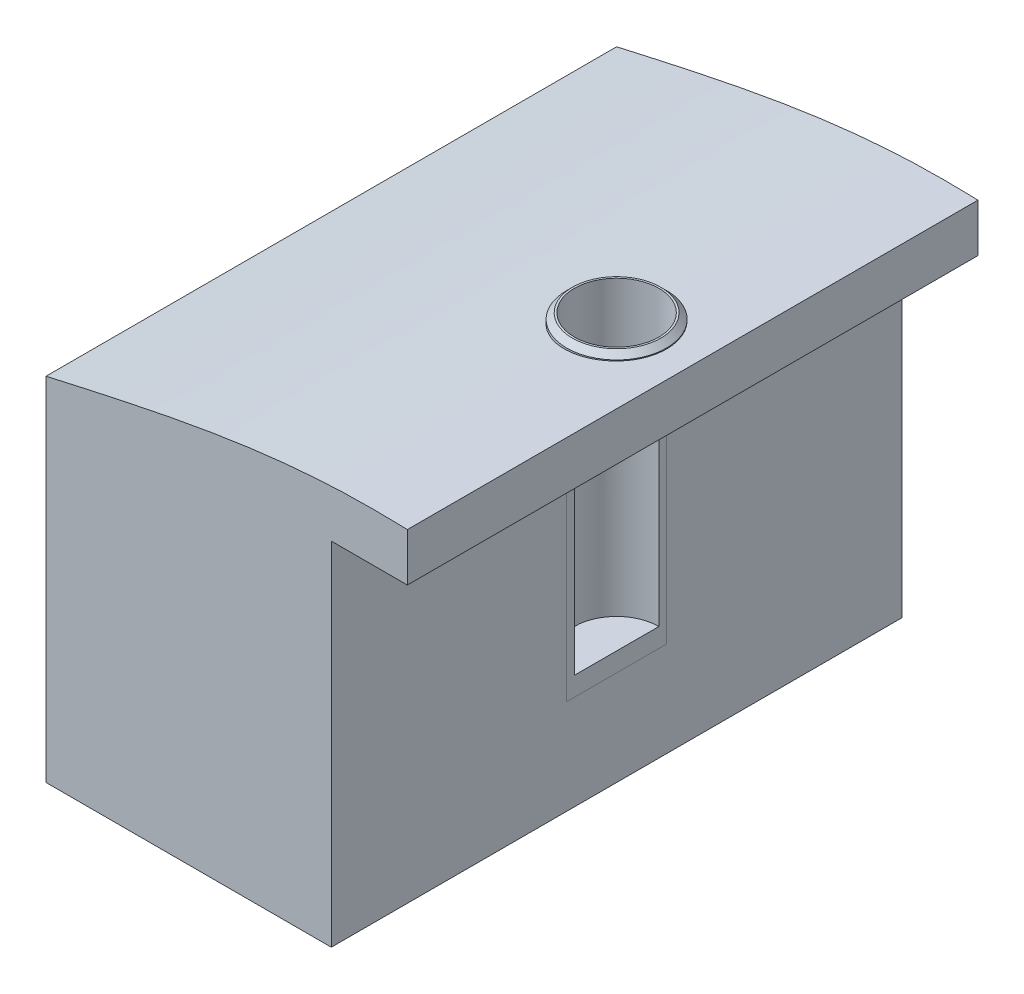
ISO-10303-21;
HEADER;
FILE_DESCRIPTION(('STEP AP214'),'2;1');
FILE_NAME('part.step','',(''),(''),'','','');
FILE_SCHEMA(('AUTOMOTIVE_DESIGN { 1 0 10303 214 1 1 1 1 }'));
ENDSEC;
DATA;
#1=APPLICATION_CONTEXT('core data for automotive mechanical design processes');
#2=APPLICATION_PROTOCOL_DEFINITION('international standard','automotive_design',2000,#1);
#3=PRODUCT_CONTEXT('',#1,'mechanical');
#4=PRODUCT('Part','Part','',(#3));
#5=PRODUCT_RELATED_PRODUCT_CATEGORY('part','',(#4));
#6=PRODUCT_DEFINITION_FORMATION('','',#4);
#7=PRODUCT_DEFINITION_CONTEXT('part definition',#1,'design');
#8=PRODUCT_DEFINITION('design','',#6,#7);
#9=PRODUCT_DEFINITION_SHAPE('','',#8);
#10=(LENGTH_UNIT() NAMED_UNIT(*) SI_UNIT(.MILLI.,.METRE.));
#11=(NAMED_UNIT(*) PLANE_ANGLE_UNIT() SI_UNIT($,.RADIAN.));
#12=(NAMED_UNIT(*) SI_UNIT($,.STERADIAN.) SOLID_ANGLE_UNIT());
#13=UNCERTAINTY_MEASURE_WITH_UNIT(LENGTH_MEASURE(1.E-05),#10,'distance_accuracy_value','');
#14=(GEOMETRIC_REPRESENTATION_CONTEXT(3) GLOBAL_UNCERTAINTY_ASSIGNED_CONTEXT((#13)) GLOBAL_UNIT_ASSIGNED_CONTEXT((#10,
#11,#12)) REPRESENTATION_CONTEXT('',''));
#15=CARTESIAN_POINT('',(0.,0.,0.));
#16=DIRECTION('',(0.,0.,1.));
#17=DIRECTION('',(1.,0.,0.));
#18=AXIS2_PLACEMENT_3D('',#15,#16,#17);
#19=CARTESIAN_POINT('',(0.,-468.351002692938,0.));
#20=DIRECTION('',(0.,1.,0.));
#21=DIRECTION('',(0.,0.,1.));
#22=AXIS2_PLACEMENT_3D('',#19,#20,#21);
#23=CYLINDRICAL_SURFACE('',#22,52.45);
#24=CARTESIAN_POINT('',(0.,1.99999999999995,0.));
#25=DIRECTION('',(0.,1.,0.));
#26=DIRECTION('',(0.,0.,1.));
#27=AXIS2_PLACEMENT_3D('',#24,#25,#26);
#28=CIRCLE('',#27,52.45);
#29=CARTESIAN_POINT('',(0.,1.99999999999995,52.45));
#30=VERTEX_POINT('',#29);
#31=EDGE_CURVE('E118',#30,#30,#28,.F.);
#32=ORIENTED_EDGE('',*,*,#31,.T.);
#33=EDGE_LOOP('',(#32));
#34=FACE_BOUND('',#33,.T.);
#35=CARTESIAN_POINT('',(0.,-50.,0.));
#36=DIRECTION('',(0.,-1.,0.));
#37=DIRECTION('',(1.,0.,0.));
#38=AXIS2_PLACEMENT_3D('',#35,#36,#37);
#39=CIRCLE('',#38,52.45);
#40=CARTESIAN_POINT('',(0.,-50.,52.45));
#41=VERTEX_POINT('',#40);
#42=CARTESIAN_POINT('',(0.,-50.,-52.45));
#43=VERTEX_POINT('',#42);
#44=EDGE_CURVE('E55',#41,#43,#39,.F.);
#45=ORIENTED_EDGE('',*,*,#44,.T.);
#46=DIRECTION('',(0.,1.,0.));
#47=VECTOR('',#46,1.);
#48=CARTESIAN_POINT('',(0.,-468.351002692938,-52.45));
#49=LINE('',#48,#47);
#50=CARTESIAN_POINT('',(0.,-320.,-52.45));
#51=VERTEX_POINT('',#50);
#52=EDGE_CURVE('E106',#43,#51,#49,.F.);
#53=ORIENTED_EDGE('',*,*,#52,.T.);
#54=CARTESIAN_POINT('',(0.,-320.,0.));
#55=DIRECTION('',(0.,1.,0.));
#56=DIRECTION('',(0.,0.,1.));
#57=AXIS2_PLACEMENT_3D('',#54,#55,#56);
#58=CIRCLE('',#57,52.45);
#59=CARTESIAN_POINT('',(0.,-320.,52.45));
#60=VERTEX_POINT('',#59);
#61=EDGE_CURVE('E113',#60,#51,#58,.F.);
#62=ORIENTED_EDGE('',*,*,#61,.F.);
#63=DIRECTION('',(0.,1.,0.));
#64=VECTOR('',#63,1.);
#65=CARTESIAN_POINT('',(0.,-468.351002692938,52.45));
#66=LINE('',#65,#64);
#67=EDGE_CURVE('E60',#60,#41,#66,.T.);
#68=ORIENTED_EDGE('',*,*,#67,.T.);
#69=EDGE_LOOP('',(#45,#53,#62,#68));
#70=FACE_BOUND('',#69,.T.);
#71=ADVANCED_FACE('F41',(#34,#70),#23,.T.);
#72=CARTESIAN_POINT('',(0.,-320.,0.));
#73=DIRECTION('',(0.,1.,0.));
#74=DIRECTION('',(0.,0.,1.));
#75=AXIS2_PLACEMENT_3D('',#72,#73,#74);
#76=PLANE('',#75);
#77=DIRECTION('',(0.,0.,-1.));
#78=VECTOR('',#77,1.);
#79=CARTESIAN_POINT('',(0.,-320.,0.));
#80=LINE('',#79,#78);
#81=EDGE_CURVE('E100',#60,#51,#80,.T.);
#82=ORIENTED_EDGE('',*,*,#81,.F.);
#83=ORIENTED_EDGE('',*,*,#61,.T.);
#84=EDGE_LOOP('',(#82,#83));
#85=FACE_BOUND('',#84,.T.);
#86=ADVANCED_FACE('F133',(#85),#76,.F.);
#87=CARTESIAN_POINT('',(0.,-445.723585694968,0.));
#88=DIRECTION('',(0.,1.,0.));
#89=DIRECTION('',(0.,0.,1.));
#90=AXIS2_PLACEMENT_3D('',#87,#88,#89);
#91=CYLINDRICAL_SURFACE('',#90,44.45);
#92=CARTESIAN_POINT('',(0.,8.,0.));
#93=DIRECTION('',(0.,1.,0.));
#94=DIRECTION('',(0.,0.,1.));
#95=AXIS2_PLACEMENT_3D('',#92,#93,#94);
#96=CIRCLE('',#95,44.45);
#97=CARTESIAN_POINT('',(0.,8.,44.45));
#98=VERTEX_POINT('',#97);
#99=EDGE_CURVE('E109',#98,#98,#96,.T.);
#100=ORIENTED_EDGE('',*,*,#99,.T.);
#101=EDGE_LOOP('',(#100));
#102=FACE_BOUND('',#101,.T.);
#103=DIRECTION('',(0.,1.,0.));
#104=VECTOR('',#103,1.);
#105=CARTESIAN_POINT('',(0.,-445.723585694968,-44.45));
#106=LINE('',#105,#104);
#107=CARTESIAN_POINT('',(0.,-50.,-44.4500000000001));
#108=VERTEX_POINT('',#107);
#109=CARTESIAN_POINT('',(0.,-300.,-44.45));
#110=VERTEX_POINT('',#109);
#111=EDGE_CURVE('E89',#108,#110,#106,.F.);
#112=ORIENTED_EDGE('',*,*,#111,.F.);
#113=CARTESIAN_POINT('',(0.,-50.,0.));
#114=DIRECTION('',(0.,-1.,0.));
#115=DIRECTION('',(1.,0.,0.));
#116=AXIS2_PLACEMENT_3D('',#113,#114,#115);
#117=CIRCLE('',#116,44.45);
#118=CARTESIAN_POINT('',(0.,-50.,44.4500000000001));
#119=VERTEX_POINT('',#118);
#120=EDGE_CURVE('E13',#119,#108,#117,.F.);
#121=ORIENTED_EDGE('',*,*,#120,.F.);
#122=DIRECTION('',(0.,1.,0.));
#123=VECTOR('',#122,1.);
#124=CARTESIAN_POINT('',(0.,-445.723585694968,44.45));
#125=LINE('',#124,#123);
#126=CARTESIAN_POINT('',(0.,-300.,44.45));
#127=VERTEX_POINT('',#126);
#128=EDGE_CURVE('E80',#127,#119,#125,.T.);
#129=ORIENTED_EDGE('',*,*,#128,.F.);
#130=CARTESIAN_POINT('',(0.,-300.,0.));
#131=DIRECTION('',(0.,1.,0.));
#132=DIRECTION('',(0.,0.,1.));
#133=AXIS2_PLACEMENT_3D('',#130,#131,#132);
#134=CIRCLE('',#133,44.45);
#135=EDGE_CURVE('E99',#127,#110,#134,.F.);
#136=ORIENTED_EDGE('',*,*,#135,.T.);
#137=EDGE_LOOP('',(#112,#121,#129,#136));
#138=FACE_BOUND('',#137,.T.);
#139=ADVANCED_FACE('F98',(#102,#138),#91,.F.);
#140=CARTESIAN_POINT('',(0.,-300.,0.));
#141=DIRECTION('',(0.,1.,0.));
#142=DIRECTION('',(0.,0.,1.));
#143=AXIS2_PLACEMENT_3D('',#140,#141,#142);
#144=PLANE('',#143);
#145=ORIENTED_EDGE('',*,*,#135,.F.);
#146=DIRECTION('',(0.,0.,-1.));
#147=VECTOR('',#146,1.);
#148=CARTESIAN_POINT('',(0.,-300.,0.));
#149=LINE('',#148,#147);
#150=EDGE_CURVE('E48',#127,#110,#149,.T.);
#151=ORIENTED_EDGE('',*,*,#150,.T.);
#152=EDGE_LOOP('',(#145,#151));
#153=FACE_BOUND('',#152,.T.);
#154=ADVANCED_FACE('F121',(#153),#144,.T.);
#155=CARTESIAN_POINT('',(0.,8.,0.));
#156=DIRECTION('',(0.,1.,0.));
#157=DIRECTION('',(0.,0.,1.));
#158=AXIS2_PLACEMENT_3D('',#155,#156,#157);
#159=PLANE('',#158);
#160=CARTESIAN_POINT('',(0.,8.,0.));
#161=DIRECTION('',(0.,1.,0.));
#162=DIRECTION('',(0.,0.,1.));
#163=AXIS2_PLACEMENT_3D('',#160,#161,#162);
#164=CIRCLE('',#163,46.45);
#165=CARTESIAN_POINT('',(0.,8.,46.45));
#166=VERTEX_POINT('',#165);
#167=EDGE_CURVE('E115',#166,#166,#164,.T.);
#168=ORIENTED_EDGE('',*,*,#167,.T.);
#169=EDGE_LOOP('',(#168));
#170=FACE_BOUND('',#169,.T.);
#171=ORIENTED_EDGE('',*,*,#99,.F.);
#172=EDGE_LOOP('',(#171));
#173=FACE_BOUND('',#172,.T.);
#174=ADVANCED_FACE('F123',(#170,#173),#159,.T.);
#175=CARTESIAN_POINT('',(0.,8.00000000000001,0.));
#176=DIRECTION('',(0.,-1.,0.));
#177=DIRECTION('',(0.,0.,-1.));
#178=AXIS2_PLACEMENT_3D('',#175,#176,#177);
#179=CONICAL_SURFACE('',#178,46.45,0.78539816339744);
#180=ORIENTED_EDGE('',*,*,#31,.F.);
#181=EDGE_LOOP('',(#180));
#182=FACE_BOUND('',#181,.T.);
#183=ORIENTED_EDGE('',*,*,#167,.F.);
#184=EDGE_LOOP('',(#183));
#185=FACE_BOUND('',#184,.T.);
#186=ADVANCED_FACE('F130',(#182,#185),#179,.T.);
#187=CARTESIAN_POINT('',(80.,-50.,1568.15532611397));
#188=DIRECTION('',(0.,-1.,0.));
#189=DIRECTION('',(1.,0.,0.));
#190=AXIS2_PLACEMENT_3D('',#187,#188,#189);
#191=PLANE('',#190);
#192=ORIENTED_EDGE('',*,*,#44,.F.);
#193=DIRECTION('',(0.,0.,-1.));
#194=VECTOR('',#193,1.);
#195=CARTESIAN_POINT('',(0.,-50.,1568.15532611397));
#196=LINE('',#195,#194);
#197=EDGE_CURVE('E83',#41,#119,#196,.T.);
#198=ORIENTED_EDGE('',*,*,#197,.T.);
#199=ORIENTED_EDGE('',*,*,#120,.T.);
#200=EDGE_CURVE('E95',#108,#43,#196,.T.);
#201=ORIENTED_EDGE('',*,*,#200,.T.);
#202=EDGE_LOOP('',(#192,#198,#199,#201));
#203=FACE_BOUND('',#202,.T.);
#204=ADVANCED_FACE('F92',(#203),#191,.T.);
#205=CARTESIAN_POINT('',(0.,-50.,1568.15532611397));
#206=DIRECTION('',(1.,0.,0.));
#207=DIRECTION('',(0.,1.,0.));
#208=AXIS2_PLACEMENT_3D('',#205,#206,#207);
#209=PLANE('',#208);
#210=ORIENTED_EDGE('',*,*,#52,.F.);
#211=ORIENTED_EDGE('',*,*,#200,.F.);
#212=ORIENTED_EDGE('',*,*,#111,.T.);
#213=ORIENTED_EDGE('',*,*,#150,.F.);
#214=ORIENTED_EDGE('',*,*,#128,.T.);
#215=ORIENTED_EDGE('',*,*,#197,.F.);
#216=ORIENTED_EDGE('',*,*,#67,.F.);
#217=ORIENTED_EDGE('',*,*,#81,.T.);
#218=EDGE_LOOP('',(#210,#211,#212,#213,#214,#215,#216,#217));
#219=FACE_BOUND('',#218,.T.);
#220=ADVANCED_FACE('F82',(#219),#209,.T.);
#221=CLOSED_SHELL('',(#71,#86,#139,#154,#174,#186,#204,#220));
#222=MANIFOLD_SOLID_BREP('B2',#221);
#223=CARTESIAN_POINT('',(300.,-19.844883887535,300.));
#224=CARTESIAN_POINT('',(199.717435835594,-7.50258695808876,300.));
#225=CARTESIAN_POINT('',(-2.00076682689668,17.3239217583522,300.));
#226=CARTESIAN_POINT('',(-200.289099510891,-27.3701210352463,300.));
#227=CARTESIAN_POINT('',(-300.,-49.844883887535,300.));
#228=B_SPLINE_CURVE_WITH_KNOTS('',3,(#223,#224,#225,#226,#227),.UNSPECIFIED.,.F.,.F.,(4,1,4),
(0.,0.49714186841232,1.),.UNSPECIFIED.);
#229=DIRECTION('',(0.,0.,-1.));
#230=VECTOR('',#229,1.);
#231=SURFACE_OF_LINEAR_EXTRUSION('',#228,#230);
#232=CARTESIAN_POINT('',(0.,0.,-52.45));
#233=CARTESIAN_POINT('',(-1.47591273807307,-0.071837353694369,-52.4499902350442));
#234=CARTESIAN_POINT('',(-2.95192049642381,-0.147481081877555,-52.3876495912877));
#235=CARTESIAN_POINT('',(-5.89329293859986,-0.305643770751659,-52.1387690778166));
#236=CARTESIAN_POINT('',(-7.35865473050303,-0.388164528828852,-51.9521966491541));
#237=CARTESIAN_POINT('',(-10.2697469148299,-0.559235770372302,-51.4559725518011));
#238=CARTESIAN_POINT('',(-11.7154537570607,-0.647792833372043,-51.1461847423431));
#239=CARTESIAN_POINT('',(-14.5751785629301,-0.829733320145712,-50.405834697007));
#240=CARTESIAN_POINT('',(-15.9891986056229,-0.923116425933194,-49.9752804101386));
#241=CARTESIAN_POINT('',(-18.7748880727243,-1.11339344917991,-48.99677765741));
#242=CARTESIAN_POINT('',(-20.1465806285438,-1.21028538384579,-48.4488946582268));
#243=CARTESIAN_POINT('',(-22.8387853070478,-1.40623797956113,-47.2394970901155));
#244=CARTESIAN_POINT('',(-24.1592966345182,-1.5052986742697,-46.577980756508));
#245=CARTESIAN_POINT('',(-26.7394981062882,-1.70407504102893,-45.1461856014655));
#246=CARTESIAN_POINT('',(-27.9992030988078,-1.80379054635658,-44.3759335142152));
#247=CARTESIAN_POINT('',(-30.4492598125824,-2.00235070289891,-42.7319718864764));
#248=CARTESIAN_POINT('',(-31.6396117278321,-2.10119535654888,-41.8582626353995));
#249=CARTESIAN_POINT('',(-33.9444852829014,-2.29659809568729,-40.0119775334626));
#250=CARTESIAN_POINT('',(-35.0588771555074,-2.3931520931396,-39.0392392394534));
#251=CARTESIAN_POINT('',(-37.2017295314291,-2.58221987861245,-37.0029511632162));
#252=CARTESIAN_POINT('',(-38.2301898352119,-2.67473365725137,-35.9394011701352));
#253=CARTESIAN_POINT('',(-40.1938652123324,-2.85417906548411,-33.7289387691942));
#254=CARTESIAN_POINT('',(-41.129077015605,-2.94111049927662,-32.5820234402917));
#255=CARTESIAN_POINT('',(-42.8994921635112,-3.10791297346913,-30.2129569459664));
#256=CARTESIAN_POINT('',(-43.73469573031,-3.18778402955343,-28.9908059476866));
#257=CARTESIAN_POINT('',(-45.2977581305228,-3.33896792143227,-26.4819996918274));
#258=CARTESIAN_POINT('',(-46.0257923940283,-3.4102947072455,-25.1954545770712));
#259=CARTESIAN_POINT('',(-47.3708765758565,-3.5433080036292,-22.5651172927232));
#260=CARTESIAN_POINT('',(-47.9879265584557,-3.60499451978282,-21.2213251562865));
#261=CARTESIAN_POINT('',(-49.1065157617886,-3.71764757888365,-18.4860956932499));
#262=CARTESIAN_POINT('',(-49.608057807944,-3.76861438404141,-17.0946595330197));
#263=CARTESIAN_POINT('',(-50.491957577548,-3.85893215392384,-14.274065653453));
#264=CARTESIAN_POINT('',(-50.8743157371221,-3.89828316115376,-12.8449080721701));
#265=CARTESIAN_POINT('',(-51.5155126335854,-3.96451678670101,-9.96590283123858));
#266=CARTESIAN_POINT('',(-51.7749219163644,-3.99145698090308,-8.51618354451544));
#267=CARTESIAN_POINT('',(-52.1709601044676,-4.0326651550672,-5.59989278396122));
#268=CARTESIAN_POINT('',(-52.3075893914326,-4.04693317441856,-4.13332136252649));
#269=CARTESIAN_POINT('',(-52.4570576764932,-4.06254474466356,-1.19384718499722));
#270=CARTESIAN_POINT('',(-52.4698993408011,-4.06388857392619,0.279055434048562));
#271=CARTESIAN_POINT('',(-52.3717043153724,-4.05362870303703,3.22067924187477));
#272=CARTESIAN_POINT('',(-52.2606677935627,-4.04202502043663,4.68940043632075));
#273=CARTESIAN_POINT('',(-51.9160876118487,-4.0061326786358,7.60749571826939));
#274=CARTESIAN_POINT('',(-51.6829351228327,-3.98188452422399,9.05691651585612));
#275=CARTESIAN_POINT('',(-51.0960639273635,-3.92115208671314,11.9308740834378));
#276=CARTESIAN_POINT('',(-50.7423455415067,-3.88466783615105,13.3554109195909));
#277=CARTESIAN_POINT('',(-49.9169205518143,-3.80009989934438,16.1695302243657));
#278=CARTESIAN_POINT('',(-49.4452134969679,-3.75201616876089,17.5591125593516));
#279=CARTESIAN_POINT('',(-48.3872331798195,-3.64508404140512,20.2935277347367));
#280=CARTESIAN_POINT('',(-47.8009596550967,-3.58623561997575,21.6383604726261));
#281=CARTESIAN_POINT('',(-46.5170761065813,-3.45868948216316,24.2758871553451));
#282=CARTESIAN_POINT('',(-45.8192946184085,-3.38997661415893,25.5684968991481));
#283=CARTESIAN_POINT('',(-44.3180604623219,-3.24394804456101,28.0903068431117));
#284=CARTESIAN_POINT('',(-43.514607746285,-3.16663233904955,29.3195070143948));
#285=CARTESIAN_POINT('',(-41.8077424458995,-3.00470767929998,31.7059512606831));
#286=CARTESIAN_POINT('',(-40.9043277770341,-2.92009857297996,32.8631938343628));
#287=CARTESIAN_POINT('',(-39.0039498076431,-2.7450056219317,35.097656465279));
#288=CARTESIAN_POINT('',(-38.0069861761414,-2.65452175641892,36.1748762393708));
#289=CARTESIAN_POINT('',(-35.9216378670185,-2.4687370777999,38.2466837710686));
#290=CARTESIAN_POINT('',(-34.8328457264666,-2.37341563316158,39.2408595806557));
#291=CARTESIAN_POINT('',(-32.5756118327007,-2.17991051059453,41.1339489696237));
#292=CARTESIAN_POINT('',(-31.4071698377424,-2.08172682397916,42.0328622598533));
#293=CARTESIAN_POINT('',(-28.9988428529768,-1.8840689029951,43.7291551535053));
#294=CARTESIAN_POINT('',(-27.7589565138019,-1.78459464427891,44.5265328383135));
#295=CARTESIAN_POINT('',(-25.2164716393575,-1.58591068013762,46.0141431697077));
#296=CARTESIAN_POINT('',(-23.9138730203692,-1.48670097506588,46.7043756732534));
#297=CARTESIAN_POINT('',(-21.2508589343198,-1.28973184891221,47.9748565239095));
#298=CARTESIAN_POINT('',(-19.8902722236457,-1.19197806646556,48.5547468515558));
#299=CARTESIAN_POINT('',(-17.1247976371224,-0.99967340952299,49.5976581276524));
#300=CARTESIAN_POINT('',(-15.7199096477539,-0.905122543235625,50.0606787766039));
#301=CARTESIAN_POINT('',(-12.8757845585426,-0.720532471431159,50.8665042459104));
#302=CARTESIAN_POINT('',(-11.4365476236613,-0.630493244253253,51.2093096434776));
#303=CARTESIAN_POINT('',(-8.53393265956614,-0.456088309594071,51.7721931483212));
#304=CARTESIAN_POINT('',(-7.07055467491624,-0.371722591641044,51.9922714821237));
#305=CARTESIAN_POINT('',(-4.1315365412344,-0.209725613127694,52.3078874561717));
#306=CARTESIAN_POINT('',(-2.65591004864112,-0.132087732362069,52.4035488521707));
#307=CARTESIAN_POINT('',(0.298526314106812,0.0157373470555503,52.4699594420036));
#308=CARTESIAN_POINT('',(1.77733618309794,0.0859245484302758,52.4407086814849));
#309=CARTESIAN_POINT('',(4.72753711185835,0.218443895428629,52.2574127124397));
#310=CARTESIAN_POINT('',(6.19892827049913,0.280776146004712,52.103369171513));
#311=CARTESIAN_POINT('',(9.1237533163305,0.397460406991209,51.6715094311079));
#312=CARTESIAN_POINT('',(10.5771872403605,0.451812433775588,51.3936934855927));
#313=CARTESIAN_POINT('',(13.4512686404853,0.552441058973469,50.7172428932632));
#314=CARTESIAN_POINT('',(14.8720024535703,0.598741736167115,50.3189786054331));
#315=CARTESIAN_POINT('',(17.6750815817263,0.68371396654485,49.404124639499));
#316=CARTESIAN_POINT('',(19.0574269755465,0.722385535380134,48.8875352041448));
#317=CARTESIAN_POINT('',(21.773835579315,0.792504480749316,47.7396762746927));
#318=CARTESIAN_POINT('',(23.1078990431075,0.823951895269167,47.1084073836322));
#319=CARTESIAN_POINT('',(25.7182115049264,0.88016574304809,45.7356604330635));
#320=CARTESIAN_POINT('',(26.9944605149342,0.90493217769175,44.9941823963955));
#321=CARTESIAN_POINT('',(29.4784632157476,0.94841042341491,43.4072818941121));
#322=CARTESIAN_POINT('',(30.6863007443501,0.967129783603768,42.5619908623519));
#323=CARTESIAN_POINT('',(33.0266030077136,0.999289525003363,40.7727311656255));
#324=CARTESIAN_POINT('',(34.1590678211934,1.0127299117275,39.8287626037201));
#325=CARTESIAN_POINT('',(36.3405684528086,1.03511805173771,37.8488486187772));
#326=CARTESIAN_POINT('',(37.389604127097,1.04406579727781,36.8129030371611));
#327=CARTESIAN_POINT('',(39.3967868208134,1.05827927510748,34.6563922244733));
#328=CARTESIAN_POINT('',(40.3549337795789,1.06354500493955,33.535826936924));
#329=CARTESIAN_POINT('',(42.1739296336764,1.07120326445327,31.2175259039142));
#330=CARTESIAN_POINT('',(43.0347358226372,1.07359453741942,30.0197566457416));
#331=CARTESIAN_POINT('',(44.6524505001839,1.07627808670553,27.5559965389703));
#332=CARTESIAN_POINT('',(45.4093589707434,1.07657036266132,26.2900056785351));
#333=CARTESIAN_POINT('',(46.8139031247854,1.07578026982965,23.6987923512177));
#334=CARTESIAN_POINT('',(47.4615386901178,1.07469789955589,22.3735698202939));
#335=CARTESIAN_POINT('',(48.6429374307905,1.07180714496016,19.6733048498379));
#336=CARTESIAN_POINT('',(49.1767005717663,1.0699987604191,18.2982623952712));
#337=CARTESIAN_POINT('',(50.1268132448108,1.06620911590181,15.5073901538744));
#338=CARTESIAN_POINT('',(50.5431011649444,1.06422776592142,14.091539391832));
#339=CARTESIAN_POINT('',(51.2549323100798,1.06053765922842,11.2298030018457));
#340=CARTESIAN_POINT('',(51.5504754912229,1.05882890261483,9.78391736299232));
#341=CARTESIAN_POINT('',(52.0187166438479,1.05600595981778,6.87238596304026));
#342=CARTESIAN_POINT('',(52.1914143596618,1.05489177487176,5.40674016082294));
#343=CARTESIAN_POINT('',(52.4127357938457,1.05344852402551,2.46611006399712));
#344=CARTESIAN_POINT('',(52.461359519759,1.05311945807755,0.991125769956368));
#345=CARTESIAN_POINT('',(52.434186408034,1.05330041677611,-1.95779247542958));
#346=CARTESIAN_POINT('',(52.3583814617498,1.05381049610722,-3.43172635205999));
#347=CARTESIAN_POINT('',(52.0828746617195,1.05558576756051,-6.36796850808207));
#348=CARTESIAN_POINT('',(51.8831727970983,1.05685095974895,-7.83027678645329));
#349=CARTESIAN_POINT('',(51.3612913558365,1.05991657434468,-10.7328754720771));
#350=CARTESIAN_POINT('',(51.039111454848,1.06171699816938,-12.173165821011));
#351=CARTESIAN_POINT('',(50.2745645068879,1.06550332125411,-15.0214855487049));
#352=CARTESIAN_POINT('',(49.8321974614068,1.06748922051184,-16.429514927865));
#353=CARTESIAN_POINT('',(48.8304108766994,1.07117646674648,-19.2033310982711));
#354=CARTESIAN_POINT('',(48.2709889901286,1.0728778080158,-20.5691170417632));
#355=CARTESIAN_POINT('',(47.0390748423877,1.07541853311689,-23.248707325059));
#356=CARTESIAN_POINT('',(46.366582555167,1.07625791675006,-24.5625116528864));
#357=CARTESIAN_POINT('',(44.9133358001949,1.07640649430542,-27.1287497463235));
#358=CARTESIAN_POINT('',(44.132585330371,1.07571574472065,-28.3811857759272));
#359=CARTESIAN_POINT('',(42.4683562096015,1.07206466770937,-30.8158320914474));
#360=CARTESIAN_POINT('',(41.5848776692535,1.06910434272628,-31.9980424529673));
#361=CARTESIAN_POINT('',(39.7216305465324,1.06012634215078,-34.2836422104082));
#362=CARTESIAN_POINT('',(38.7418778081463,1.05410916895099,-35.387044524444));
#363=CARTESIAN_POINT('',(36.6929297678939,1.0382053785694,-37.5073983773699));
#364=CARTESIAN_POINT('',(35.6237341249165,1.02831874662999,-38.524349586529));
#365=CARTESIAN_POINT('',(33.4032481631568,1.00386329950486,-40.4647997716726));
#366=CARTESIAN_POINT('',(32.2519378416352,0.98929334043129,-41.3882758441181));
#367=CARTESIAN_POINT('',(29.8756849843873,0.954692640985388,-43.1349072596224));
#368=CARTESIAN_POINT('',(28.6507436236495,0.934661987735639,-43.9580642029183));
#369=CARTESIAN_POINT('',(26.1360642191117,0.888422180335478,-45.4981579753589));
#370=CARTESIAN_POINT('',(24.8463314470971,0.862213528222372,-46.2151034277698));
#371=CARTESIAN_POINT('',(22.2110932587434,0.802983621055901,-47.5378100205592));
#372=CARTESIAN_POINT('',(20.8655842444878,0.769961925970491,-48.1435639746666));
#373=CARTESIAN_POINT('',(18.1300297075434,0.696635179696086,-49.2389400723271));
#374=CARTESIAN_POINT('',(16.7400341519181,0.656338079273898,-49.7286876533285));
#375=CARTESIAN_POINT('',(13.9242124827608,0.568069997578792,-50.5893764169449));
#376=CARTESIAN_POINT('',(12.4983957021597,0.520100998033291,-50.9603482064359));
#377=CARTESIAN_POINT('',(10.1518978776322,0.43544607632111,-51.4665424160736));
#378=CARTESIAN_POINT('',(9.23883192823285,0.40112245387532,-51.6382535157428));
#379=CARTESIAN_POINT('',(7.40486776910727,0.329323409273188,-51.9329647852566));
#380=CARTESIAN_POINT('',(6.48396896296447,0.29184774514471,-52.0559612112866));
#381=CARTESIAN_POINT('',(4.63707398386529,0.213764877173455,-52.2528706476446));
#382=CARTESIAN_POINT('',(3.71107782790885,0.173157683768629,-52.326783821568));
#383=CARTESIAN_POINT('',(1.85673352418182,0.0888688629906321,-52.4253496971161));
#384=CARTESIAN_POINT('',(0.928385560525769,0.0451874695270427,-52.4500061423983));
#385=CARTESIAN_POINT('',(0.,0.,-52.45));
#386=B_SPLINE_CURVE_WITH_KNOTS('',3,(#232,#233,#234,#235,#236,#237,#238,#239,#240,#241,#242,
#243,#244,#245,#246,#247,#248,#249,#250,#251,#252,#253,#254,#255,#256,#257,#258,#259,#260,#261,
#262,#263,#264,#265,#266,#267,#268,#269,#270,#271,#272,#273,#274,#275,#276,#277,#278,#279,#280,
#281,#282,#283,#284,#285,#286,#287,#288,#289,#290,#291,#292,#293,#294,#295,#296,#297,#298,#299,
#300,#301,#302,#303,#304,#305,#306,#307,#308,#309,#310,#311,#312,#313,#314,#315,#316,#317,#318,
#319,#320,#321,#322,#323,#324,#325,#326,#327,#328,#329,#330,#331,#332,#333,#334,#335,#336,#337,
#338,#339,#340,#341,#342,#343,#344,#345,#346,#347,#348,#349,#350,#351,#352,#353,#354,#355,#356,
#357,#358,#359,#360,#361,#362,#363,#364,#365,#366,#367,#368,#369,#370,#371,#372,#373,#374,#375,
#376,#377,#378,#379,#380,#381,#382,#383,#384,#385),.UNSPECIFIED.,.T.,.F.,(4,2,2,2,2,2,2,2,2,2,2,
2,2,2,2,2,2,2,2,2,2,2,2,2,2,2,2,2,2,2,2,2,2,2,2,2,2,2,2,2,2,2,2,2,2,2,2,2,2,2,2,2,2,2,2,2,2,2,2,
2,2,2,2,2,2,2,2,2,2,2,2,2,2,2,2,2,4),(0.,4.4321502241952,8.86546249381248,13.3036868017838,
17.7416190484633,22.1770814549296,26.6126127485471,31.0470553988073,35.4814856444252,
39.9233108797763,44.3651464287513,48.8071376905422,53.2491190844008,57.683746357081,
62.1183710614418,66.5528872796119,70.98738727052,75.4011023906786,79.8148037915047,
84.2284101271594,88.6420104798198,93.0415585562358,97.4410949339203,101.840648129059,
106.240211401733,110.646606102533,115.053002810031,119.459491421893,123.865995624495,
128.293200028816,132.720417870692,137.147719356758,141.575026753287,146.016462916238,
150.457910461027,154.899336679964,159.340754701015,163.777751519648,168.214746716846,
172.651682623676,177.088609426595,181.512029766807,185.935441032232,190.358829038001,
194.782216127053,199.200059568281,203.617898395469,208.035744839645,212.453594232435,
216.873374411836,221.293155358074,225.712941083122,230.132728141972,234.55482894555,
238.976931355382,243.399042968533,247.821154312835,252.243553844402,256.66595376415,
261.08836539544,265.510776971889,269.933277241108,274.355778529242,278.778116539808,
283.200449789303,287.62205646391,292.043680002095,296.466384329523,300.889018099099,
305.311292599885,309.733852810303,314.151608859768,318.568225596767,321.356164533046,
324.14431768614,326.93246154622,329.720393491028),.UNSPECIFIED.);
#387=CARTESIAN_POINT('',(0.,0.,-52.45));
#388=VERTEX_POINT('',#387);
#389=EDGE_CURVE('E316',#388,#388,#386,.T.);
#390=ORIENTED_EDGE('',*,*,#389,.F.);
#391=EDGE_LOOP('',(#390));
#392=FACE_BOUND('',#391,.T.);
#393=DIRECTION('',(0.,0.,-1.));
#394=VECTOR('',#393,1.);
#395=CARTESIAN_POINT('',(80.,0.523130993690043,300.));
#396=LINE('',#395,#394);
#397=CARTESIAN_POINT('',(80.,0.523130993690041,-300.));
#398=VERTEX_POINT('',#397);
#399=CARTESIAN_POINT('',(80.,0.523130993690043,300.));
#400=VERTEX_POINT('',#399);
#401=EDGE_CURVE('E262',#398,#400,#396,.F.);
#402=ORIENTED_EDGE('',*,*,#401,.F.);
#403=CARTESIAN_POINT('',(300.,-19.844883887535,-300.));
#404=CARTESIAN_POINT('',(199.717435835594,-7.50258695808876,-300.));
#405=CARTESIAN_POINT('',(-2.00076682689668,17.3239217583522,-300.));
#406=CARTESIAN_POINT('',(-200.289099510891,-27.3701210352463,-300.));
#407=CARTESIAN_POINT('',(-300.,-49.844883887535,-300.));
#408=B_SPLINE_CURVE_WITH_KNOTS('',3,(#403,#404,#405,#406,#407),.UNSPECIFIED.,.F.,.F.,(4,1,4),
(0.,0.49714186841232,1.),.UNSPECIFIED.);
#409=CARTESIAN_POINT('',(-300.,-49.844883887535,-300.));
#410=VERTEX_POINT('',#409);
#411=EDGE_CURVE('E288',#398,#410,#408,.T.);
#412=ORIENTED_EDGE('',*,*,#411,.T.);
#413=DIRECTION('',(0.,0.,-1.));
#414=VECTOR('',#413,1.);
#415=CARTESIAN_POINT('',(-300.,-49.844883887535,300.));
#416=LINE('',#415,#414);
#417=CARTESIAN_POINT('',(-300.,-49.844883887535,300.));
#418=VERTEX_POINT('',#417);
#419=EDGE_CURVE('E313',#418,#410,#416,.T.);
#420=ORIENTED_EDGE('',*,*,#419,.F.);
#421=EDGE_CURVE('E299',#400,#418,#228,.T.);
#422=ORIENTED_EDGE('',*,*,#421,.F.);
#423=EDGE_LOOP('',(#402,#412,#420,#422));
#424=FACE_BOUND('',#423,.T.);
#425=ADVANCED_FACE('F185',(#392,#424),#231,.F.);
#426=CARTESIAN_POINT('',(-300.,-419.844883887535,300.));
#427=DIRECTION('',(0.,1.,0.));
#428=DIRECTION('',(0.,0.,1.));
#429=AXIS2_PLACEMENT_3D('',#426,#427,#428);
#430=PLANE('',#429);
#431=DIRECTION('',(0.,0.,-1.));
#432=VECTOR('',#431,1.);
#433=CARTESIAN_POINT('',(0.,-419.844883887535,1568.15532611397));
#434=LINE('',#433,#432);
#435=CARTESIAN_POINT('',(0.,-419.844883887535,300.));
#436=VERTEX_POINT('',#435);
#437=CARTESIAN_POINT('',(0.,-419.844883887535,-300.));
#438=VERTEX_POINT('',#437);
#439=EDGE_CURVE('E201',#436,#438,#434,.T.);
#440=ORIENTED_EDGE('',*,*,#439,.F.);
#441=DIRECTION('',(1.,0.,0.));
#442=VECTOR('',#441,1.);
#443=CARTESIAN_POINT('',(-300.,-419.844883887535,300.));
#444=LINE('',#443,#442);
#445=CARTESIAN_POINT('',(-300.,-419.844883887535,300.));
#446=VERTEX_POINT('',#445);
#447=EDGE_CURVE('E274',#446,#436,#444,.T.);
#448=ORIENTED_EDGE('',*,*,#447,.F.);
#449=DIRECTION('',(0.,0.,-1.));
#450=VECTOR('',#449,1.);
#451=CARTESIAN_POINT('',(-300.,-419.844883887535,300.));
#452=LINE('',#451,#450);
#453=CARTESIAN_POINT('',(-300.,-419.844883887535,-300.));
#454=VERTEX_POINT('',#453);
#455=EDGE_CURVE('E310',#446,#454,#452,.T.);
#456=ORIENTED_EDGE('',*,*,#455,.T.);
#457=DIRECTION('',(1.,0.,0.));
#458=VECTOR('',#457,1.);
#459=CARTESIAN_POINT('',(-300.,-419.844883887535,-300.));
#460=LINE('',#459,#458);
#461=EDGE_CURVE('E297',#454,#438,#460,.T.);
#462=ORIENTED_EDGE('',*,*,#461,.T.);
#463=EDGE_LOOP('',(#440,#448,#456,#462));
#464=FACE_BOUND('',#463,.T.);
#465=ADVANCED_FACE('F337',(#464),#430,.F.);
#466=CARTESIAN_POINT('',(-1.71490713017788,-0.0851728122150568,300.));
#467=DIRECTION('',(0.,0.,-1.));
#468=DIRECTION('',(-1.,0.,0.));
#469=AXIS2_PLACEMENT_3D('',#466,#467,#468);
#470=PLANE('',#469);
#471=DIRECTION('',(0.,-1.,0.));
#472=VECTOR('',#471,1.);
#473=CARTESIAN_POINT('',(80.,-0.0851728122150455,300.));
#474=LINE('',#473,#472);
#475=CARTESIAN_POINT('',(80.,-50.,300.));
#476=VERTEX_POINT('',#475);
#477=EDGE_CURVE('E283',#400,#476,#474,.T.);
#478=ORIENTED_EDGE('',*,*,#477,.F.);
#479=ORIENTED_EDGE('',*,*,#421,.T.);
#480=DIRECTION('',(0.,-1.,0.));
#481=VECTOR('',#480,1.);
#482=CARTESIAN_POINT('',(-300.,-49.844883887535,300.));
#483=LINE('',#482,#481);
#484=EDGE_CURVE('E304',#418,#446,#483,.T.);
#485=ORIENTED_EDGE('',*,*,#484,.T.);
#486=ORIENTED_EDGE('',*,*,#447,.T.);
#487=DIRECTION('',(0.,-1.,0.));
#488=VECTOR('',#487,1.);
#489=CARTESIAN_POINT('',(0.,-0.0851728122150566,300.));
#490=LINE('',#489,#488);
#491=CARTESIAN_POINT('',(0.,-50.,300.));
#492=VERTEX_POINT('',#491);
#493=EDGE_CURVE('E266',#492,#436,#490,.T.);
#494=ORIENTED_EDGE('',*,*,#493,.F.);
#495=DIRECTION('',(-1.,0.,0.));
#496=VECTOR('',#495,1.);
#497=CARTESIAN_POINT('',(-1.71490713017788,-50.,300.));
#498=LINE('',#497,#496);
#499=EDGE_CURVE('E252',#476,#492,#498,.T.);
#500=ORIENTED_EDGE('',*,*,#499,.F.);
#501=EDGE_LOOP('',(#478,#479,#485,#486,#494,#500));
#502=FACE_BOUND('',#501,.T.);
#503=ADVANCED_FACE('F272',(#502),#470,.F.);
#504=CARTESIAN_POINT('',(-1.71490713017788,-0.0851728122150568,-300.));
#505=DIRECTION('',(0.,0.,-1.));
#506=DIRECTION('',(-1.,0.,0.));
#507=AXIS2_PLACEMENT_3D('',#504,#505,#506);
#508=PLANE('',#507);
#509=ORIENTED_EDGE('',*,*,#411,.F.);
#510=DIRECTION('',(0.,-1.,0.));
#511=VECTOR('',#510,1.);
#512=CARTESIAN_POINT('',(80.,-0.0851728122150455,-300.));
#513=LINE('',#512,#511);
#514=CARTESIAN_POINT('',(80.,-50.,-300.));
#515=VERTEX_POINT('',#514);
#516=EDGE_CURVE('E39',#398,#515,#513,.T.);
#517=ORIENTED_EDGE('',*,*,#516,.T.);
#518=DIRECTION('',(-1.,0.,0.));
#519=VECTOR('',#518,1.);
#520=CARTESIAN_POINT('',(-1.71490713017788,-50.,-300.));
#521=LINE('',#520,#519);
#522=CARTESIAN_POINT('',(0.,-50.,-300.));
#523=VERTEX_POINT('',#522);
#524=EDGE_CURVE('E263',#515,#523,#521,.T.);
#525=ORIENTED_EDGE('',*,*,#524,.T.);
#526=DIRECTION('',(0.,-1.,0.));
#527=VECTOR('',#526,1.);
#528=CARTESIAN_POINT('',(0.,-0.0851728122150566,-300.));
#529=LINE('',#528,#527);
#530=EDGE_CURVE('E275',#523,#438,#529,.T.);
#531=ORIENTED_EDGE('',*,*,#530,.T.);
#532=ORIENTED_EDGE('',*,*,#461,.F.);
#533=DIRECTION('',(0.,-1.,0.));
#534=VECTOR('',#533,1.);
#535=CARTESIAN_POINT('',(-300.,-49.844883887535,-300.));
#536=LINE('',#535,#534);
#537=EDGE_CURVE('E292',#410,#454,#536,.T.);
#538=ORIENTED_EDGE('',*,*,#537,.F.);
#539=EDGE_LOOP('',(#509,#517,#525,#531,#532,#538));
#540=FACE_BOUND('',#539,.T.);
#541=ADVANCED_FACE('F329',(#540),#508,.T.);
#542=CARTESIAN_POINT('',(0.,17.3249217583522,0.));
#543=DIRECTION('',(0.,-1.,0.));
#544=DIRECTION('',(0.,0.,-1.));
#545=AXIS2_PLACEMENT_3D('',#542,#543,#544);
#546=CYLINDRICAL_SURFACE('',#545,52.45);
#547=ORIENTED_EDGE('',*,*,#389,.T.);
#548=EDGE_LOOP('',(#547));
#549=FACE_BOUND('',#548,.T.);
#550=CARTESIAN_POINT('',(0.,-50.,0.));
#551=DIRECTION('',(0.,-1.,0.));
#552=DIRECTION('',(1.,0.,0.));
#553=AXIS2_PLACEMENT_3D('',#550,#551,#552);
#554=CIRCLE('',#553,52.45);
#555=CARTESIAN_POINT('',(0.,-50.,-52.4500000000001));
#556=VERTEX_POINT('',#555);
#557=CARTESIAN_POINT('',(0.,-50.,52.4500000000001));
#558=VERTEX_POINT('',#557);
#559=EDGE_CURVE('E194',#556,#558,#554,.T.);
#560=ORIENTED_EDGE('',*,*,#559,.T.);
#561=DIRECTION('',(0.,-1.,0.));
#562=VECTOR('',#561,1.);
#563=CARTESIAN_POINT('',(0.,17.3249217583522,52.45));
#564=LINE('',#563,#562);
#565=CARTESIAN_POINT('',(0.,-320.,52.45));
#566=VERTEX_POINT('',#565);
#567=EDGE_CURVE('E268',#558,#566,#564,.T.);
#568=ORIENTED_EDGE('',*,*,#567,.T.);
#569=CARTESIAN_POINT('',(0.,-320.,0.));
#570=DIRECTION('',(0.,1.,0.));
#571=DIRECTION('',(0.,0.,1.));
#572=AXIS2_PLACEMENT_3D('',#569,#570,#571);
#573=CIRCLE('',#572,52.45);
#574=CARTESIAN_POINT('',(0.,-320.,-52.45));
#575=VERTEX_POINT('',#574);
#576=EDGE_CURVE('E285',#575,#566,#573,.T.);
#577=ORIENTED_EDGE('',*,*,#576,.F.);
#578=DIRECTION('',(0.,-1.,0.));
#579=VECTOR('',#578,1.);
#580=CARTESIAN_POINT('',(0.,17.3249217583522,-52.45));
#581=LINE('',#580,#579);
#582=EDGE_CURVE('E208',#575,#556,#581,.F.);
#583=ORIENTED_EDGE('',*,*,#582,.T.);
#584=EDGE_LOOP('',(#560,#568,#577,#583));
#585=FACE_BOUND('',#584,.T.);
#586=ADVANCED_FACE('F323',(#549,#585),#546,.F.);
#587=CARTESIAN_POINT('',(0.,-320.,0.));
#588=DIRECTION('',(0.,1.,0.));
#589=DIRECTION('',(0.,0.,1.));
#590=AXIS2_PLACEMENT_3D('',#587,#588,#589);
#591=PLANE('',#590);
#592=ORIENTED_EDGE('',*,*,#576,.T.);
#593=DIRECTION('',(0.,0.,-1.));
#594=VECTOR('',#593,1.);
#595=CARTESIAN_POINT('',(0.,-320.,0.));
#596=LINE('',#595,#594);
#597=EDGE_CURVE('E322',#566,#575,#596,.T.);
#598=ORIENTED_EDGE('',*,*,#597,.T.);
#599=EDGE_LOOP('',(#592,#598));
#600=FACE_BOUND('',#599,.T.);
#601=ADVANCED_FACE('F328',(#600),#591,.T.);
#602=CARTESIAN_POINT('',(-300.,-49.844883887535,300.));
#603=DIRECTION('',(1.,0.,0.));
#604=DIRECTION('',(0.,0.,-1.));
#605=AXIS2_PLACEMENT_3D('',#602,#603,#604);
#606=PLANE('',#605);
#607=ORIENTED_EDGE('',*,*,#537,.T.);
#608=ORIENTED_EDGE('',*,*,#455,.F.);
#609=ORIENTED_EDGE('',*,*,#484,.F.);
#610=ORIENTED_EDGE('',*,*,#419,.T.);
#611=EDGE_LOOP('',(#607,#608,#609,#610));
#612=FACE_BOUND('',#611,.T.);
#613=ADVANCED_FACE('F340',(#612),#606,.F.);
#614=CARTESIAN_POINT('',(80.,50.,1568.15532611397));
#615=DIRECTION('',(1.,0.,0.));
#616=DIRECTION('',(0.,1.,0.));
#617=AXIS2_PLACEMENT_3D('',#614,#615,#616);
#618=PLANE('',#617);
#619=ORIENTED_EDGE('',*,*,#401,.T.);
#620=ORIENTED_EDGE('',*,*,#477,.T.);
#621=DIRECTION('',(0.,0.,-1.));
#622=VECTOR('',#621,1.);
#623=CARTESIAN_POINT('',(80.,-50.,1568.15532611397));
#624=LINE('',#623,#622);
#625=EDGE_CURVE('E258',#476,#515,#624,.T.);
#626=ORIENTED_EDGE('',*,*,#625,.T.);
#627=ORIENTED_EDGE('',*,*,#516,.F.);
#628=EDGE_LOOP('',(#619,#620,#626,#627));
#629=FACE_BOUND('',#628,.T.);
#630=ADVANCED_FACE('F342',(#629),#618,.T.);
#631=CARTESIAN_POINT('',(80.,-50.,1568.15532611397));
#632=DIRECTION('',(0.,-1.,0.));
#633=DIRECTION('',(1.,0.,0.));
#634=AXIS2_PLACEMENT_3D('',#631,#632,#633);
#635=PLANE('',#634);
#636=ORIENTED_EDGE('',*,*,#625,.F.);
#637=ORIENTED_EDGE('',*,*,#499,.T.);
#638=DIRECTION('',(0.,0.,-1.));
#639=VECTOR('',#638,1.);
#640=CARTESIAN_POINT('',(0.,-50.,1568.15532611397));
#641=LINE('',#640,#639);
#642=EDGE_CURVE('E255',#492,#558,#641,.T.);
#643=ORIENTED_EDGE('',*,*,#642,.T.);
#644=ORIENTED_EDGE('',*,*,#559,.F.);
#645=EDGE_CURVE('E269',#556,#523,#641,.T.);
#646=ORIENTED_EDGE('',*,*,#645,.T.);
#647=ORIENTED_EDGE('',*,*,#524,.F.);
#648=EDGE_LOOP('',(#636,#637,#643,#644,#646,#647));
#649=FACE_BOUND('',#648,.T.);
#650=ADVANCED_FACE('F254',(#649),#635,.T.);
#651=CARTESIAN_POINT('',(0.,-50.,1568.15532611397));
#652=DIRECTION('',(1.,0.,0.));
#653=DIRECTION('',(0.,1.,0.));
#654=AXIS2_PLACEMENT_3D('',#651,#652,#653);
#655=PLANE('',#654);
#656=ORIENTED_EDGE('',*,*,#642,.F.);
#657=ORIENTED_EDGE('',*,*,#493,.T.);
#658=ORIENTED_EDGE('',*,*,#439,.T.);
#659=ORIENTED_EDGE('',*,*,#530,.F.);
#660=ORIENTED_EDGE('',*,*,#645,.F.);
#661=ORIENTED_EDGE('',*,*,#582,.F.);
#662=ORIENTED_EDGE('',*,*,#597,.F.);
#663=ORIENTED_EDGE('',*,*,#567,.F.);
#664=EDGE_LOOP('',(#656,#657,#658,#659,#660,#661,#662,#663));
#665=FACE_BOUND('',#664,.T.);
#666=ADVANCED_FACE('F265',(#665),#655,.T.);
#667=CLOSED_SHELL('',(#425,#465,#503,#541,#586,#601,#613,#630,#650,#666));
#668=MANIFOLD_SOLID_BREP('B7',#667);
#669=ADVANCED_BREP_SHAPE_REPRESENTATION('',(#18,#222,#668),#14);
#670=SHAPE_DEFINITION_REPRESENTATION(#9,#669);
ENDSEC;
END-ISO-10303-21;
